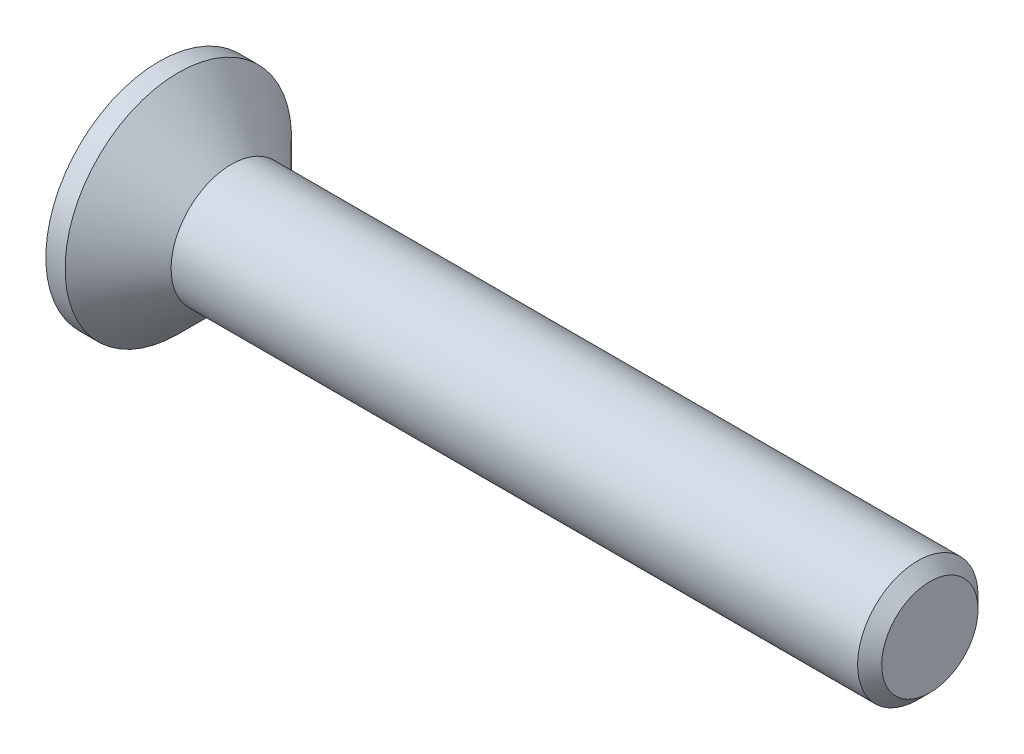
ISO-10303-21;
HEADER;
FILE_DESCRIPTION(('STEP AP214'),'2;1');
FILE_NAME('part.step','',(''),(''),'','','');
FILE_SCHEMA(('AUTOMOTIVE_DESIGN { 1 0 10303 214 1 1 1 1 }'));
ENDSEC;
DATA;
#1=APPLICATION_CONTEXT('core data for automotive mechanical design processes');
#2=APPLICATION_PROTOCOL_DEFINITION('international standard','automotive_design',2000,#1);
#3=PRODUCT_CONTEXT('',#1,'mechanical');
#4=PRODUCT('Part','Part','',(#3));
#5=PRODUCT_RELATED_PRODUCT_CATEGORY('part','',(#4));
#6=PRODUCT_DEFINITION_FORMATION('','',#4);
#7=PRODUCT_DEFINITION_CONTEXT('part definition',#1,'design');
#8=PRODUCT_DEFINITION('design','',#6,#7);
#9=PRODUCT_DEFINITION_SHAPE('','',#8);
#10=(LENGTH_UNIT() NAMED_UNIT(*) SI_UNIT(.MILLI.,.METRE.));
#11=(NAMED_UNIT(*) PLANE_ANGLE_UNIT() SI_UNIT($,.RADIAN.));
#12=(NAMED_UNIT(*) SI_UNIT($,.STERADIAN.) SOLID_ANGLE_UNIT());
#13=UNCERTAINTY_MEASURE_WITH_UNIT(LENGTH_MEASURE(1.E-05),#10,'distance_accuracy_value','');
#14=(GEOMETRIC_REPRESENTATION_CONTEXT(3) GLOBAL_UNCERTAINTY_ASSIGNED_CONTEXT((#13)) GLOBAL_UNIT_ASSIGNED_CONTEXT((#10,
#11,#12)) REPRESENTATION_CONTEXT('',''));
#15=CARTESIAN_POINT('',(0.,0.,0.));
#16=DIRECTION('',(0.,0.,1.));
#17=DIRECTION('',(1.,0.,0.));
#18=AXIS2_PLACEMENT_3D('',#15,#16,#17);
#19=CARTESIAN_POINT('',(0.,0.,0.));
#20=DIRECTION('',(-1.,0.,0.));
#21=DIRECTION('',(0.,-1.,0.));
#22=AXIS2_PLACEMENT_3D('',#19,#20,#21);
#23=CONICAL_SURFACE('',#22,1.25,0.78539816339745);
#24=CARTESIAN_POINT('',(-1.1,0.,0.));
#25=DIRECTION('',(-1.,0.,0.));
#26=DIRECTION('',(0.,-1.,0.));
#27=AXIS2_PLACEMENT_3D('',#24,#25,#26);
#28=CIRCLE('',#27,2.35);
#29=CARTESIAN_POINT('',(-1.1,-2.35,0.));
#30=VERTEX_POINT('',#29);
#31=EDGE_CURVE('E189',#30,#30,#28,.T.);
#32=ORIENTED_EDGE('',*,*,#31,.F.);
#33=EDGE_LOOP('',(#32));
#34=FACE_BOUND('',#33,.T.);
#35=CARTESIAN_POINT('',(0.,0.,0.));
#36=DIRECTION('',(-1.,0.,0.));
#37=DIRECTION('',(0.,-1.,0.));
#38=AXIS2_PLACEMENT_3D('',#35,#36,#37);
#39=CIRCLE('',#38,1.25);
#40=CARTESIAN_POINT('',(0.,-1.25,0.));
#41=VERTEX_POINT('',#40);
#42=EDGE_CURVE('E212',#41,#41,#39,.T.);
#43=ORIENTED_EDGE('',*,*,#42,.T.);
#44=EDGE_LOOP('',(#43));
#45=FACE_BOUND('',#44,.T.);
#46=ADVANCED_FACE('F33',(#34,#45),#23,.T.);
#47=CARTESIAN_POINT('',(-1.5,0.,0.));
#48=DIRECTION('',(-1.,0.,0.));
#49=DIRECTION('',(0.,-1.,0.));
#50=AXIS2_PLACEMENT_3D('',#47,#48,#49);
#51=CYLINDRICAL_SURFACE('',#50,1.25);
#52=CARTESIAN_POINT('',(14.25,0.,0.));
#53=DIRECTION('',(-1.,0.,0.));
#54=DIRECTION('',(0.,-1.,0.));
#55=AXIS2_PLACEMENT_3D('',#52,#53,#54);
#56=CIRCLE('',#55,1.25);
#57=CARTESIAN_POINT('',(14.25,-1.25,0.));
#58=VERTEX_POINT('',#57);
#59=EDGE_CURVE('E41',#58,#58,#56,.T.);
#60=ORIENTED_EDGE('',*,*,#59,.T.);
#61=EDGE_LOOP('',(#60));
#62=FACE_BOUND('',#61,.T.);
#63=ORIENTED_EDGE('',*,*,#42,.F.);
#64=EDGE_LOOP('',(#63));
#65=FACE_BOUND('',#64,.T.);
#66=ADVANCED_FACE('F217',(#62,#65),#51,.T.);
#67=CARTESIAN_POINT('',(14.5,0.,0.));
#68=DIRECTION('',(-1.,0.,0.));
#69=DIRECTION('',(0.,-1.,0.));
#70=AXIS2_PLACEMENT_3D('',#67,#68,#69);
#71=PLANE('',#70);
#72=CARTESIAN_POINT('',(14.5,0.,0.));
#73=DIRECTION('',(-1.,0.,0.));
#74=DIRECTION('',(0.,-1.,0.));
#75=AXIS2_PLACEMENT_3D('',#72,#73,#74);
#76=CIRCLE('',#75,0.999999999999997);
#77=CARTESIAN_POINT('',(14.5,-0.999999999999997,0.));
#78=VERTEX_POINT('',#77);
#79=EDGE_CURVE('E11',#78,#78,#76,.F.);
#80=ORIENTED_EDGE('',*,*,#79,.T.);
#81=EDGE_LOOP('',(#80));
#82=FACE_BOUND('',#81,.T.);
#83=ADVANCED_FACE('F239',(#82),#71,.F.);
#84=CARTESIAN_POINT('',(-1.5,2.35,0.));
#85=DIRECTION('',(1.,0.,0.));
#86=DIRECTION('',(0.,1.,0.));
#87=AXIS2_PLACEMENT_3D('',#84,#85,#86);
#88=PLANE('',#87);
#89=DIRECTION('',(0.,0.,-1.));
#90=VECTOR('',#89,1.);
#91=CARTESIAN_POINT('',(-1.5,0.34,-1.35));
#92=LINE('',#91,#90);
#93=CARTESIAN_POINT('',(-1.5,0.34,-0.34));
#94=VERTEX_POINT('',#93);
#95=CARTESIAN_POINT('',(-1.5,0.34,-1.35));
#96=VERTEX_POINT('',#95);
#97=EDGE_CURVE('E158',#94,#96,#92,.T.);
#98=ORIENTED_EDGE('',*,*,#97,.F.);
#99=DIRECTION('',(0.,-1.,0.));
#100=VECTOR('',#99,1.);
#101=CARTESIAN_POINT('',(-1.5,0.34,-0.34));
#102=LINE('',#101,#100);
#103=CARTESIAN_POINT('',(-1.5,1.35,-0.34));
#104=VERTEX_POINT('',#103);
#105=EDGE_CURVE('E48',#104,#94,#102,.T.);
#106=ORIENTED_EDGE('',*,*,#105,.F.);
#107=DIRECTION('',(0.,0.,-1.));
#108=VECTOR('',#107,1.);
#109=CARTESIAN_POINT('',(-1.5,1.35,-0.34));
#110=LINE('',#109,#108);
#111=CARTESIAN_POINT('',(-1.5,1.35,0.34));
#112=VERTEX_POINT('',#111);
#113=EDGE_CURVE('E185',#112,#104,#110,.T.);
#114=ORIENTED_EDGE('',*,*,#113,.F.);
#115=DIRECTION('',(0.,1.,0.));
#116=VECTOR('',#115,1.);
#117=CARTESIAN_POINT('',(-1.5,1.35,0.34));
#118=LINE('',#117,#116);
#119=CARTESIAN_POINT('',(-1.5,0.34,0.34));
#120=VERTEX_POINT('',#119);
#121=EDGE_CURVE('E183',#120,#112,#118,.T.);
#122=ORIENTED_EDGE('',*,*,#121,.F.);
#123=DIRECTION('',(0.,0.,-1.));
#124=VECTOR('',#123,1.);
#125=CARTESIAN_POINT('',(-1.5,0.34,0.34));
#126=LINE('',#125,#124);
#127=CARTESIAN_POINT('',(-1.5,0.34,1.35));
#128=VERTEX_POINT('',#127);
#129=EDGE_CURVE('E132',#128,#120,#126,.T.);
#130=ORIENTED_EDGE('',*,*,#129,.F.);
#131=DIRECTION('',(0.,1.,0.));
#132=VECTOR('',#131,1.);
#133=CARTESIAN_POINT('',(-1.5,0.34,1.35));
#134=LINE('',#133,#132);
#135=CARTESIAN_POINT('',(-1.5,-0.34,1.35));
#136=VERTEX_POINT('',#135);
#137=EDGE_CURVE('E179',#136,#128,#134,.T.);
#138=ORIENTED_EDGE('',*,*,#137,.F.);
#139=DIRECTION('',(0.,0.,1.));
#140=VECTOR('',#139,1.);
#141=CARTESIAN_POINT('',(-1.5,-0.34,1.35));
#142=LINE('',#141,#140);
#143=CARTESIAN_POINT('',(-1.5,-0.34,0.34));
#144=VERTEX_POINT('',#143);
#145=EDGE_CURVE('E176',#144,#136,#142,.T.);
#146=ORIENTED_EDGE('',*,*,#145,.F.);
#147=DIRECTION('',(0.,1.,0.));
#148=VECTOR('',#147,1.);
#149=CARTESIAN_POINT('',(-1.5,-0.34,0.34));
#150=LINE('',#149,#148);
#151=CARTESIAN_POINT('',(-1.5,-1.35,0.34));
#152=VERTEX_POINT('',#151);
#153=EDGE_CURVE('E173',#152,#144,#150,.T.);
#154=ORIENTED_EDGE('',*,*,#153,.F.);
#155=DIRECTION('',(0.,0.,1.));
#156=VECTOR('',#155,1.);
#157=CARTESIAN_POINT('',(-1.5,-1.35,0.34));
#158=LINE('',#157,#156);
#159=CARTESIAN_POINT('',(-1.5,-1.35,-0.34));
#160=VERTEX_POINT('',#159);
#161=EDGE_CURVE('E170',#160,#152,#158,.T.);
#162=ORIENTED_EDGE('',*,*,#161,.F.);
#163=DIRECTION('',(0.,-1.,0.));
#164=VECTOR('',#163,1.);
#165=CARTESIAN_POINT('',(-1.5,-1.35,-0.34));
#166=LINE('',#165,#164);
#167=CARTESIAN_POINT('',(-1.5,-0.34,-0.34));
#168=VERTEX_POINT('',#167);
#169=EDGE_CURVE('E167',#168,#160,#166,.T.);
#170=ORIENTED_EDGE('',*,*,#169,.F.);
#171=DIRECTION('',(0.,0.,1.));
#172=VECTOR('',#171,1.);
#173=CARTESIAN_POINT('',(-1.5,-0.34,-0.34));
#174=LINE('',#173,#172);
#175=CARTESIAN_POINT('',(-1.5,-0.34,-1.35));
#176=VERTEX_POINT('',#175);
#177=EDGE_CURVE('E164',#176,#168,#174,.T.);
#178=ORIENTED_EDGE('',*,*,#177,.F.);
#179=DIRECTION('',(0.,-1.,0.));
#180=VECTOR('',#179,1.);
#181=CARTESIAN_POINT('',(-1.5,-0.34,-1.35));
#182=LINE('',#181,#180);
#183=EDGE_CURVE('E161',#96,#176,#182,.T.);
#184=ORIENTED_EDGE('',*,*,#183,.F.);
#185=EDGE_LOOP('',(#98,#106,#114,#122,#130,#138,#146,#154,#162,#170,#178,#184));
#186=FACE_BOUND('',#185,.T.);
#187=CARTESIAN_POINT('',(-1.5,0.,0.));
#188=DIRECTION('',(-1.,0.,0.));
#189=DIRECTION('',(0.,-1.,0.));
#190=AXIS2_PLACEMENT_3D('',#187,#188,#189);
#191=CIRCLE('',#190,2.35);
#192=CARTESIAN_POINT('',(-1.5,-2.35,0.));
#193=VERTEX_POINT('',#192);
#194=EDGE_CURVE('E209',#193,#193,#191,.T.);
#195=ORIENTED_EDGE('',*,*,#194,.T.);
#196=EDGE_LOOP('',(#195));
#197=FACE_BOUND('',#196,.T.);
#198=ADVANCED_FACE('F230',(#186,#197),#88,.F.);
#199=CARTESIAN_POINT('',(-1.5,0.,0.));
#200=DIRECTION('',(-1.,0.,0.));
#201=DIRECTION('',(0.,-1.,0.));
#202=AXIS2_PLACEMENT_3D('',#199,#200,#201);
#203=CYLINDRICAL_SURFACE('',#202,2.35);
#204=ORIENTED_EDGE('',*,*,#194,.F.);
#205=EDGE_LOOP('',(#204));
#206=FACE_BOUND('',#205,.T.);
#207=ORIENTED_EDGE('',*,*,#31,.T.);
#208=EDGE_LOOP('',(#207));
#209=FACE_BOUND('',#208,.T.);
#210=ADVANCED_FACE('F222',(#206,#209),#203,.T.);
#211=CARTESIAN_POINT('',(14.25,0.,0.));
#212=DIRECTION('',(-1.,0.,0.));
#213=DIRECTION('',(0.,-1.,0.));
#214=AXIS2_PLACEMENT_3D('',#211,#212,#213);
#215=CONICAL_SURFACE('',#214,1.25,0.785398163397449);
#216=ORIENTED_EDGE('',*,*,#79,.F.);
#217=EDGE_LOOP('',(#216));
#218=FACE_BOUND('',#217,.T.);
#219=ORIENTED_EDGE('',*,*,#59,.F.);
#220=EDGE_LOOP('',(#219));
#221=FACE_BOUND('',#220,.T.);
#222=ADVANCED_FACE('F35',(#218,#221),#215,.T.);
#223=CARTESIAN_POINT('',(-0.25,0.34,-0.34));
#224=DIRECTION('',(0.,0.,-1.));
#225=DIRECTION('',(-1.,0.,0.));
#226=AXIS2_PLACEMENT_3D('',#223,#224,#225);
#227=PLANE('',#226);
#228=ORIENTED_EDGE('',*,*,#105,.T.);
#229=DIRECTION('',(-1.,0.,0.));
#230=VECTOR('',#229,1.);
#231=CARTESIAN_POINT('',(-0.25,0.34,-0.34));
#232=LINE('',#231,#230);
#233=CARTESIAN_POINT('',(-0.25,0.34,-0.34));
#234=VERTEX_POINT('',#233);
#235=EDGE_CURVE('E96',#234,#94,#232,.T.);
#236=ORIENTED_EDGE('',*,*,#235,.F.);
#237=DIRECTION('',(0.,-1.,0.));
#238=VECTOR('',#237,1.);
#239=CARTESIAN_POINT('',(-0.25,0.34,-0.34));
#240=LINE('',#239,#238);
#241=CARTESIAN_POINT('',(-0.25,1.35,-0.34));
#242=VERTEX_POINT('',#241);
#243=EDGE_CURVE('E187',#242,#234,#240,.T.);
#244=ORIENTED_EDGE('',*,*,#243,.F.);
#245=DIRECTION('',(-1.,0.,0.));
#246=VECTOR('',#245,1.);
#247=CARTESIAN_POINT('',(-0.25,1.35,-0.34));
#248=LINE('',#247,#246);
#249=EDGE_CURVE('E56',#242,#104,#248,.T.);
#250=ORIENTED_EDGE('',*,*,#249,.T.);
#251=EDGE_LOOP('',(#228,#236,#244,#250));
#252=FACE_BOUND('',#251,.T.);
#253=ADVANCED_FACE('F221',(#252),#227,.F.);
#254=CARTESIAN_POINT('',(-0.25,1.35,-0.34));
#255=DIRECTION('',(0.,1.,0.));
#256=DIRECTION('',(-1.,0.,0.));
#257=AXIS2_PLACEMENT_3D('',#254,#255,#256);
#258=PLANE('',#257);
#259=ORIENTED_EDGE('',*,*,#113,.T.);
#260=ORIENTED_EDGE('',*,*,#249,.F.);
#261=DIRECTION('',(0.,0.,-1.));
#262=VECTOR('',#261,1.);
#263=CARTESIAN_POINT('',(-0.25,1.35,-0.34));
#264=LINE('',#263,#262);
#265=CARTESIAN_POINT('',(-0.25,1.35,0.34));
#266=VERTEX_POINT('',#265);
#267=EDGE_CURVE('E144',#266,#242,#264,.T.);
#268=ORIENTED_EDGE('',*,*,#267,.F.);
#269=DIRECTION('',(-1.,0.,0.));
#270=VECTOR('',#269,1.);
#271=CARTESIAN_POINT('',(-0.25,1.35,0.34));
#272=LINE('',#271,#270);
#273=EDGE_CURVE('E136',#266,#112,#272,.T.);
#274=ORIENTED_EDGE('',*,*,#273,.T.);
#275=EDGE_LOOP('',(#259,#260,#268,#274));
#276=FACE_BOUND('',#275,.T.);
#277=ADVANCED_FACE('F228',(#276),#258,.F.);
#278=CARTESIAN_POINT('',(-0.25,1.35,0.34));
#279=DIRECTION('',(0.,0.,1.));
#280=DIRECTION('',(1.,0.,0.));
#281=AXIS2_PLACEMENT_3D('',#278,#279,#280);
#282=PLANE('',#281);
#283=ORIENTED_EDGE('',*,*,#121,.T.);
#284=ORIENTED_EDGE('',*,*,#273,.F.);
#285=DIRECTION('',(0.,1.,0.));
#286=VECTOR('',#285,1.);
#287=CARTESIAN_POINT('',(-0.25,1.35,0.34));
#288=LINE('',#287,#286);
#289=CARTESIAN_POINT('',(-0.25,0.34,0.34));
#290=VERTEX_POINT('',#289);
#291=EDGE_CURVE('E140',#290,#266,#288,.T.);
#292=ORIENTED_EDGE('',*,*,#291,.F.);
#293=DIRECTION('',(-1.,0.,0.));
#294=VECTOR('',#293,1.);
#295=CARTESIAN_POINT('',(-0.25,0.34,0.34));
#296=LINE('',#295,#294);
#297=EDGE_CURVE('E125',#290,#120,#296,.T.);
#298=ORIENTED_EDGE('',*,*,#297,.T.);
#299=EDGE_LOOP('',(#283,#284,#292,#298));
#300=FACE_BOUND('',#299,.T.);
#301=ADVANCED_FACE('F141',(#300),#282,.F.);
#302=CARTESIAN_POINT('',(-0.25,0.34,0.34));
#303=DIRECTION('',(0.,1.,0.));
#304=DIRECTION('',(-1.,0.,0.));
#305=AXIS2_PLACEMENT_3D('',#302,#303,#304);
#306=PLANE('',#305);
#307=ORIENTED_EDGE('',*,*,#129,.T.);
#308=ORIENTED_EDGE('',*,*,#297,.F.);
#309=DIRECTION('',(0.,0.,-1.));
#310=VECTOR('',#309,1.);
#311=CARTESIAN_POINT('',(-0.25,0.34,0.34));
#312=LINE('',#311,#310);
#313=CARTESIAN_POINT('',(-0.25,0.34,1.35));
#314=VERTEX_POINT('',#313);
#315=EDGE_CURVE('E129',#314,#290,#312,.T.);
#316=ORIENTED_EDGE('',*,*,#315,.F.);
#317=DIRECTION('',(-1.,0.,0.));
#318=VECTOR('',#317,1.);
#319=CARTESIAN_POINT('',(-0.25,0.34,1.35));
#320=LINE('',#319,#318);
#321=EDGE_CURVE('E137',#314,#128,#320,.T.);
#322=ORIENTED_EDGE('',*,*,#321,.T.);
#323=EDGE_LOOP('',(#307,#308,#316,#322));
#324=FACE_BOUND('',#323,.T.);
#325=ADVANCED_FACE('F127',(#324),#306,.F.);
#326=CARTESIAN_POINT('',(-0.25,0.34,1.35));
#327=DIRECTION('',(0.,0.,1.));
#328=DIRECTION('',(1.,0.,0.));
#329=AXIS2_PLACEMENT_3D('',#326,#327,#328);
#330=PLANE('',#329);
#331=ORIENTED_EDGE('',*,*,#137,.T.);
#332=ORIENTED_EDGE('',*,*,#321,.F.);
#333=DIRECTION('',(0.,1.,0.));
#334=VECTOR('',#333,1.);
#335=CARTESIAN_POINT('',(-0.25,0.34,1.35));
#336=LINE('',#335,#334);
#337=CARTESIAN_POINT('',(-0.25,-0.34,1.35));
#338=VERTEX_POINT('',#337);
#339=EDGE_CURVE('E150',#338,#314,#336,.T.);
#340=ORIENTED_EDGE('',*,*,#339,.F.);
#341=DIRECTION('',(-1.,0.,0.));
#342=VECTOR('',#341,1.);
#343=CARTESIAN_POINT('',(-0.25,-0.34,1.35));
#344=LINE('',#343,#342);
#345=EDGE_CURVE('E192',#338,#136,#344,.T.);
#346=ORIENTED_EDGE('',*,*,#345,.T.);
#347=EDGE_LOOP('',(#331,#332,#340,#346));
#348=FACE_BOUND('',#347,.T.);
#349=ADVANCED_FACE('F277',(#348),#330,.F.);
#350=CARTESIAN_POINT('',(-0.25,-0.34,1.35));
#351=DIRECTION('',(0.,-1.,0.));
#352=DIRECTION('',(1.,0.,0.));
#353=AXIS2_PLACEMENT_3D('',#350,#351,#352);
#354=PLANE('',#353);
#355=ORIENTED_EDGE('',*,*,#145,.T.);
#356=ORIENTED_EDGE('',*,*,#345,.F.);
#357=DIRECTION('',(0.,0.,1.));
#358=VECTOR('',#357,1.);
#359=CARTESIAN_POINT('',(-0.25,-0.34,1.35));
#360=LINE('',#359,#358);
#361=CARTESIAN_POINT('',(-0.25,-0.34,0.34));
#362=VERTEX_POINT('',#361);
#363=EDGE_CURVE('E152',#362,#338,#360,.T.);
#364=ORIENTED_EDGE('',*,*,#363,.F.);
#365=DIRECTION('',(-1.,0.,0.));
#366=VECTOR('',#365,1.);
#367=CARTESIAN_POINT('',(-0.25,-0.34,0.34));
#368=LINE('',#367,#366);
#369=EDGE_CURVE('E194',#362,#144,#368,.T.);
#370=ORIENTED_EDGE('',*,*,#369,.T.);
#371=EDGE_LOOP('',(#355,#356,#364,#370));
#372=FACE_BOUND('',#371,.T.);
#373=ADVANCED_FACE('F273',(#372),#354,.F.);
#374=CARTESIAN_POINT('',(-0.25,-0.34,0.34));
#375=DIRECTION('',(0.,0.,1.));
#376=DIRECTION('',(1.,0.,0.));
#377=AXIS2_PLACEMENT_3D('',#374,#375,#376);
#378=PLANE('',#377);
#379=ORIENTED_EDGE('',*,*,#153,.T.);
#380=ORIENTED_EDGE('',*,*,#369,.F.);
#381=DIRECTION('',(0.,1.,0.));
#382=VECTOR('',#381,1.);
#383=CARTESIAN_POINT('',(-0.25,-0.34,0.34));
#384=LINE('',#383,#382);
#385=CARTESIAN_POINT('',(-0.25,-1.35,0.34));
#386=VERTEX_POINT('',#385);
#387=EDGE_CURVE('E422',#386,#362,#384,.T.);
#388=ORIENTED_EDGE('',*,*,#387,.F.);
#389=DIRECTION('',(-1.,0.,0.));
#390=VECTOR('',#389,1.);
#391=CARTESIAN_POINT('',(-0.25,-1.35,0.34));
#392=LINE('',#391,#390);
#393=EDGE_CURVE('E196',#386,#152,#392,.T.);
#394=ORIENTED_EDGE('',*,*,#393,.T.);
#395=EDGE_LOOP('',(#379,#380,#388,#394));
#396=FACE_BOUND('',#395,.T.);
#397=ADVANCED_FACE('F269',(#396),#378,.F.);
#398=CARTESIAN_POINT('',(-0.25,-1.35,0.34));
#399=DIRECTION('',(0.,-1.,0.));
#400=DIRECTION('',(1.,0.,0.));
#401=AXIS2_PLACEMENT_3D('',#398,#399,#400);
#402=PLANE('',#401);
#403=ORIENTED_EDGE('',*,*,#161,.T.);
#404=ORIENTED_EDGE('',*,*,#393,.F.);
#405=DIRECTION('',(0.,0.,1.));
#406=VECTOR('',#405,1.);
#407=CARTESIAN_POINT('',(-0.25,-1.35,0.34));
#408=LINE('',#407,#406);
#409=CARTESIAN_POINT('',(-0.25,-1.35,-0.34));
#410=VERTEX_POINT('',#409);
#411=EDGE_CURVE('E419',#410,#386,#408,.T.);
#412=ORIENTED_EDGE('',*,*,#411,.F.);
#413=DIRECTION('',(-1.,0.,0.));
#414=VECTOR('',#413,1.);
#415=CARTESIAN_POINT('',(-0.25,-1.35,-0.34));
#416=LINE('',#415,#414);
#417=EDGE_CURVE('E198',#410,#160,#416,.T.);
#418=ORIENTED_EDGE('',*,*,#417,.T.);
#419=EDGE_LOOP('',(#403,#404,#412,#418));
#420=FACE_BOUND('',#419,.T.);
#421=ADVANCED_FACE('F265',(#420),#402,.F.);
#422=CARTESIAN_POINT('',(-0.25,-1.35,-0.34));
#423=DIRECTION('',(0.,0.,-1.));
#424=DIRECTION('',(-1.,0.,0.));
#425=AXIS2_PLACEMENT_3D('',#422,#423,#424);
#426=PLANE('',#425);
#427=ORIENTED_EDGE('',*,*,#169,.T.);
#428=ORIENTED_EDGE('',*,*,#417,.F.);
#429=DIRECTION('',(0.,-1.,0.));
#430=VECTOR('',#429,1.);
#431=CARTESIAN_POINT('',(-0.25,-1.35,-0.34));
#432=LINE('',#431,#430);
#433=CARTESIAN_POINT('',(-0.25,-0.34,-0.34));
#434=VERTEX_POINT('',#433);
#435=EDGE_CURVE('E416',#434,#410,#432,.T.);
#436=ORIENTED_EDGE('',*,*,#435,.F.);
#437=DIRECTION('',(-1.,0.,0.));
#438=VECTOR('',#437,1.);
#439=CARTESIAN_POINT('',(-0.25,-0.34,-0.34));
#440=LINE('',#439,#438);
#441=EDGE_CURVE('E200',#434,#168,#440,.T.);
#442=ORIENTED_EDGE('',*,*,#441,.T.);
#443=EDGE_LOOP('',(#427,#428,#436,#442));
#444=FACE_BOUND('',#443,.T.);
#445=ADVANCED_FACE('F261',(#444),#426,.F.);
#446=CARTESIAN_POINT('',(-0.25,-0.34,-0.34));
#447=DIRECTION('',(0.,-1.,0.));
#448=DIRECTION('',(1.,0.,0.));
#449=AXIS2_PLACEMENT_3D('',#446,#447,#448);
#450=PLANE('',#449);
#451=ORIENTED_EDGE('',*,*,#177,.T.);
#452=ORIENTED_EDGE('',*,*,#441,.F.);
#453=DIRECTION('',(0.,0.,1.));
#454=VECTOR('',#453,1.);
#455=CARTESIAN_POINT('',(-0.25,-0.34,-0.34));
#456=LINE('',#455,#454);
#457=CARTESIAN_POINT('',(-0.25,-0.34,-1.35));
#458=VERTEX_POINT('',#457);
#459=EDGE_CURVE('E413',#458,#434,#456,.T.);
#460=ORIENTED_EDGE('',*,*,#459,.F.);
#461=DIRECTION('',(-1.,0.,0.));
#462=VECTOR('',#461,1.);
#463=CARTESIAN_POINT('',(-0.25,-0.34,-1.35));
#464=LINE('',#463,#462);
#465=EDGE_CURVE('E202',#458,#176,#464,.T.);
#466=ORIENTED_EDGE('',*,*,#465,.T.);
#467=EDGE_LOOP('',(#451,#452,#460,#466));
#468=FACE_BOUND('',#467,.T.);
#469=ADVANCED_FACE('F257',(#468),#450,.F.);
#470=CARTESIAN_POINT('',(-0.25,-0.34,-1.35));
#471=DIRECTION('',(0.,0.,-1.));
#472=DIRECTION('',(-1.,0.,0.));
#473=AXIS2_PLACEMENT_3D('',#470,#471,#472);
#474=PLANE('',#473);
#475=ORIENTED_EDGE('',*,*,#183,.T.);
#476=ORIENTED_EDGE('',*,*,#465,.F.);
#477=DIRECTION('',(0.,-1.,0.));
#478=VECTOR('',#477,1.);
#479=CARTESIAN_POINT('',(-0.25,-0.34,-1.35));
#480=LINE('',#479,#478);
#481=CARTESIAN_POINT('',(-0.25,0.34,-1.35));
#482=VERTEX_POINT('',#481);
#483=EDGE_CURVE('E408',#482,#458,#480,.T.);
#484=ORIENTED_EDGE('',*,*,#483,.F.);
#485=DIRECTION('',(-1.,0.,0.));
#486=VECTOR('',#485,1.);
#487=CARTESIAN_POINT('',(-0.25,0.34,-1.35));
#488=LINE('',#487,#486);
#489=EDGE_CURVE('E204',#482,#96,#488,.T.);
#490=ORIENTED_EDGE('',*,*,#489,.T.);
#491=EDGE_LOOP('',(#475,#476,#484,#490));
#492=FACE_BOUND('',#491,.T.);
#493=ADVANCED_FACE('F253',(#492),#474,.F.);
#494=CARTESIAN_POINT('',(-0.25,0.34,-1.35));
#495=DIRECTION('',(0.,1.,0.));
#496=DIRECTION('',(-1.,0.,0.));
#497=AXIS2_PLACEMENT_3D('',#494,#495,#496);
#498=PLANE('',#497);
#499=ORIENTED_EDGE('',*,*,#97,.T.);
#500=ORIENTED_EDGE('',*,*,#489,.F.);
#501=DIRECTION('',(0.,0.,-1.));
#502=VECTOR('',#501,1.);
#503=CARTESIAN_POINT('',(-0.25,0.34,-1.35));
#504=LINE('',#503,#502);
#505=EDGE_CURVE('E406',#234,#482,#504,.T.);
#506=ORIENTED_EDGE('',*,*,#505,.F.);
#507=ORIENTED_EDGE('',*,*,#235,.T.);
#508=EDGE_LOOP('',(#499,#500,#506,#507));
#509=FACE_BOUND('',#508,.T.);
#510=ADVANCED_FACE('F250',(#509),#498,.F.);
#511=CARTESIAN_POINT('',(-0.25,0.,0.));
#512=DIRECTION('',(1.,0.,0.));
#513=DIRECTION('',(0.,0.,-1.));
#514=AXIS2_PLACEMENT_3D('',#511,#512,#513);
#515=PLANE('',#514);
#516=ORIENTED_EDGE('',*,*,#243,.T.);
#517=ORIENTED_EDGE('',*,*,#505,.T.);
#518=ORIENTED_EDGE('',*,*,#483,.T.);
#519=ORIENTED_EDGE('',*,*,#459,.T.);
#520=ORIENTED_EDGE('',*,*,#435,.T.);
#521=ORIENTED_EDGE('',*,*,#411,.T.);
#522=ORIENTED_EDGE('',*,*,#387,.T.);
#523=ORIENTED_EDGE('',*,*,#363,.T.);
#524=ORIENTED_EDGE('',*,*,#339,.T.);
#525=ORIENTED_EDGE('',*,*,#315,.T.);
#526=ORIENTED_EDGE('',*,*,#291,.T.);
#527=ORIENTED_EDGE('',*,*,#267,.T.);
#528=EDGE_LOOP('',(#516,#517,#518,#519,#520,#521,#522,#523,#524,#525,#526,#527));
#529=FACE_BOUND('',#528,.T.);
#530=ADVANCED_FACE('F147',(#529),#515,.F.);
#531=CLOSED_SHELL('',(#46,#66,#83,#198,#210,#222,#253,#277,#301,#325,#349,#373,#397,#421,#445,
#469,#493,#510,#530));
#532=MANIFOLD_SOLID_BREP('B2',#531);
#533=ADVANCED_BREP_SHAPE_REPRESENTATION('',(#18,#532),#14);
#534=SHAPE_DEFINITION_REPRESENTATION(#9,#533);
ENDSEC;
END-ISO-10303-21;
